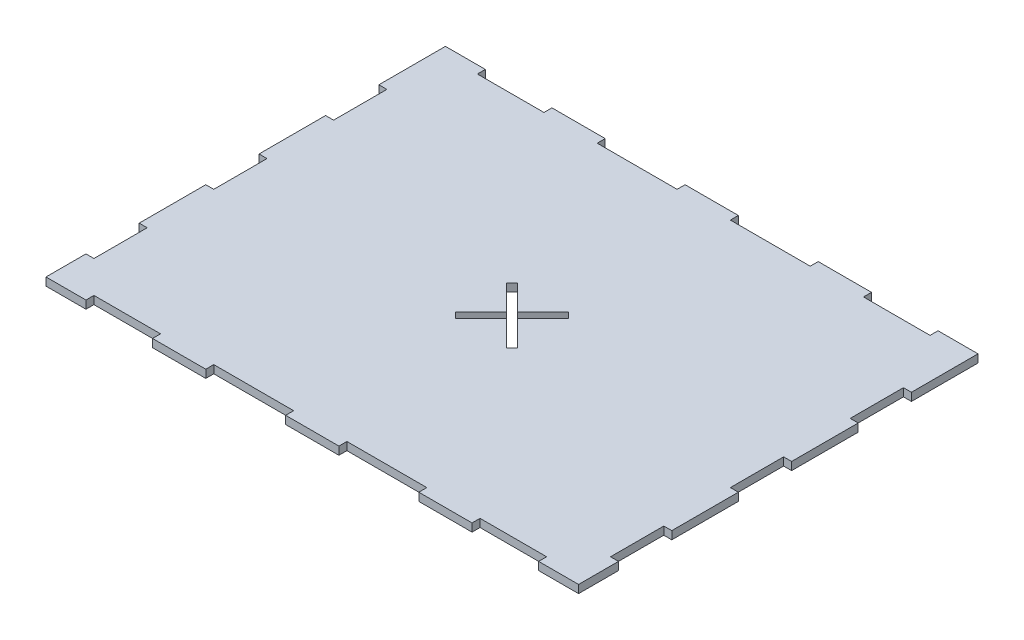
from build123d import *

# Parameters (mm, degrees)
CROQUIS3_W              = 200
CROQUIS3_H              = 150
SALIENTE_EXTRUIR1_DEPTH = 3
CROQUIS4_W              = 3
CROQUIS4_H              = 20
CROQUIS4_W_2            = 25
CROQUIS4_H_2            = 3
CROQUIS4_W_3            = 30
CORTAR_EXTRUIR1_DEPTH   = 6


with BuildPart() as part:
    # Croquis3 → Saliente-Extruir1 (new body)
    with BuildSketch(Plane(origin=(0, 0, 0), x_dir=(1, 0, 0), z_dir=(0, 1, 0))):
        with Locations((100, 75)):
            Rectangle(CROQUIS3_W, CROQUIS3_H)
    extrude(amount=SALIENTE_EXTRUIR1_DEPTH)

    # Croquis4 → Cortar-Extruir1 (cut)
    with BuildSketch(Plane(origin=(0, 3, 0), x_dir=(1, 0, 0), z_dir=(0, 1, 0))):
        with Locations((1.5, 115)):
            Rectangle(CROQUIS4_W, CROQUIS4_H)
        with Locations((172.5, 1.5)):
            Rectangle(CROQUIS4_W_2, CROQUIS4_H_2)
        with Locations((27.5, 148.5)):
            Rectangle(CROQUIS4_W_2, CROQUIS4_H_2)
        with Locations((75, 148.5)):
            Rectangle(CROQUIS4_W_3, CROQUIS4_H_2)
        with Locations((125, 148.5)):
            Rectangle(CROQUIS4_W_3, CROQUIS4_H_2)
        with Locations((172.5, 148.5)):
            Rectangle(CROQUIS4_W_2, CROQUIS4_H_2)
        with Locations((125, 1.5)):
            Rectangle(CROQUIS4_W_3, CROQUIS4_H_2)
        with Locations((75, 1.5)):
            Rectangle(CROQUIS4_W_3, CROQUIS4_H_2)
        with Locations((27.5, 1.5)):
            Rectangle(CROQUIS4_W_2, CROQUIS4_H_2)
        with Locations((1.5, 70)):
            Rectangle(CROQUIS4_W, CROQUIS4_H)
        with Locations((1.5, 25)):
            Rectangle(CROQUIS4_W, CROQUIS4_H)
        with Locations((198.5, 25)):
            Rectangle(CROQUIS4_W, CROQUIS4_H)
        with Locations((198.5, 70)):
            Rectangle(CROQUIS4_W, CROQUIS4_H)
        with Locations((198.5, 115)):
            Rectangle(CROQUIS4_W, CROQUIS4_H)
        Polygon((100, 77.121320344), (109.545941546, 86.66726189), (111.66726189, 84.545941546), (102.121320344, 75), (111.66726189, 65.454058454), (109.545941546, 63.33273811), (100, 72.878679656), (90.454058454, 63.33273811), (88.33273811, 65.454058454), (97.878679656, 75), (88.33273811, 84.545941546), (90.454058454, 86.66726189), align=None)
    extrude(amount=-CORTAR_EXTRUIR1_DEPTH, mode=Mode.SUBTRACT)


solid = part.part
